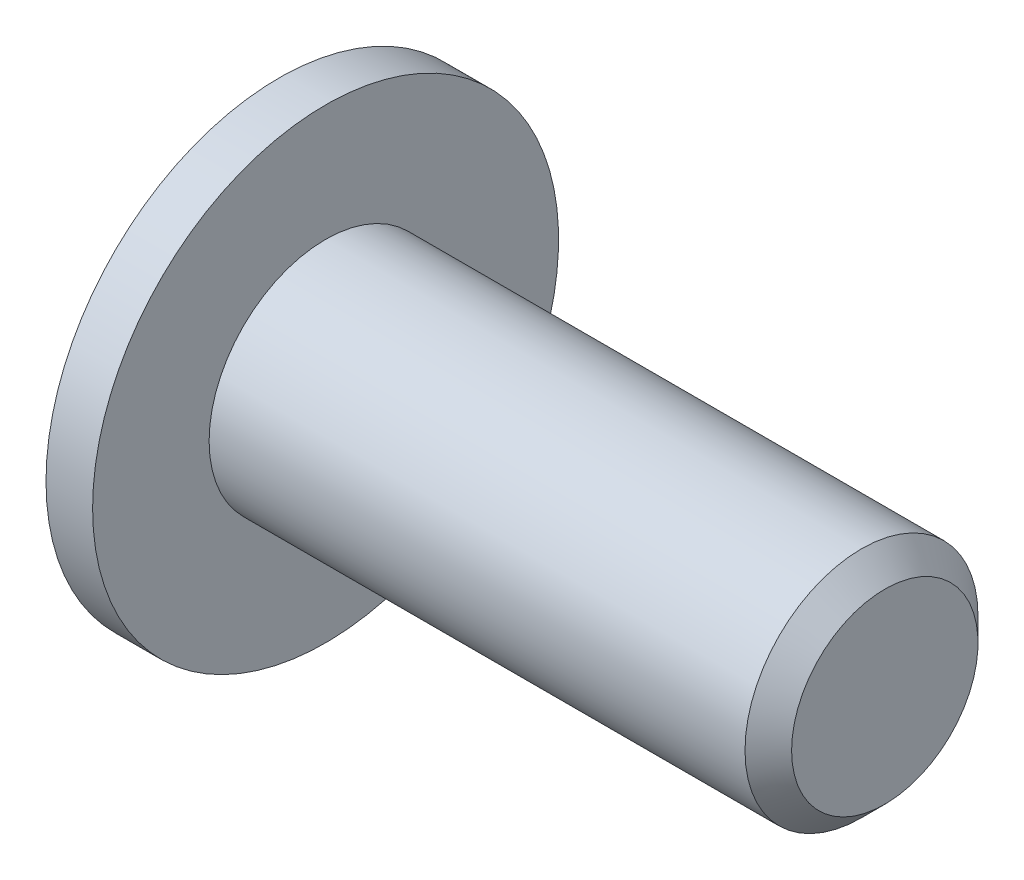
from build123d import *

# Parameters (mm, degrees)
FASE1_SIZE                      = 0.5
SCHNITT_LINEAR_START            = -1
SCHNITT_LINEAR_AUSTRAGEN1_DEPTH = 13.928388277


with BuildPart() as part:
    # Skizze1 → Rotation1 (revolve)
    with BuildSketch(Plane.XY, mode=Mode.PRIVATE) as rotation1_sk:
        with BuildLine():
            Line((12, 0), (12, 2.5))
            Line((12, 2.5), (0, 2.5))
            Line((0, 2.5), (0, 5))
            Line((0, 5), (-1, 5))
            Line((-1, 5), (-1, 3.570714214))
            ThreePointArc((-1, 3.570714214), (-2.109772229, 1.936491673), (-2.5, 0))
            Line((-2.5, 0), (12, 0))
        make_face()
    revolve(rotation1_sk.sketch.rotate(Axis((0, 0, 0), (1, 0, 0)), 90), axis=Axis((0, 0, 0), (1, 0, 0)))

    # Fase1
    fase1_edges = [part.edges().sort_by_distance(p)[0] for p in [
        (12, 0, -2.5),
    ]]
    chamfer(fase1_edges, length=FASE1_SIZE)

    # Skizze2 → Schnitt-Linear austragen1 (cut, through all)
    with BuildSketch(Plane(origin=(0, 0, 0), x_dir=(0, 0, -1), z_dir=(1, 0, 0)).offset(SCHNITT_LINEAR_START)):
        Polygon((0, 1.732050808), (-1.5, 0.866025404), (-1.5, -0.866025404), (0, -1.732050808), (1.5, -0.866025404), (1.5, 0.866025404), align=None)
    extrude(amount=-SCHNITT_LINEAR_AUSTRAGEN1_DEPTH, mode=Mode.SUBTRACT)


solid = part.part
